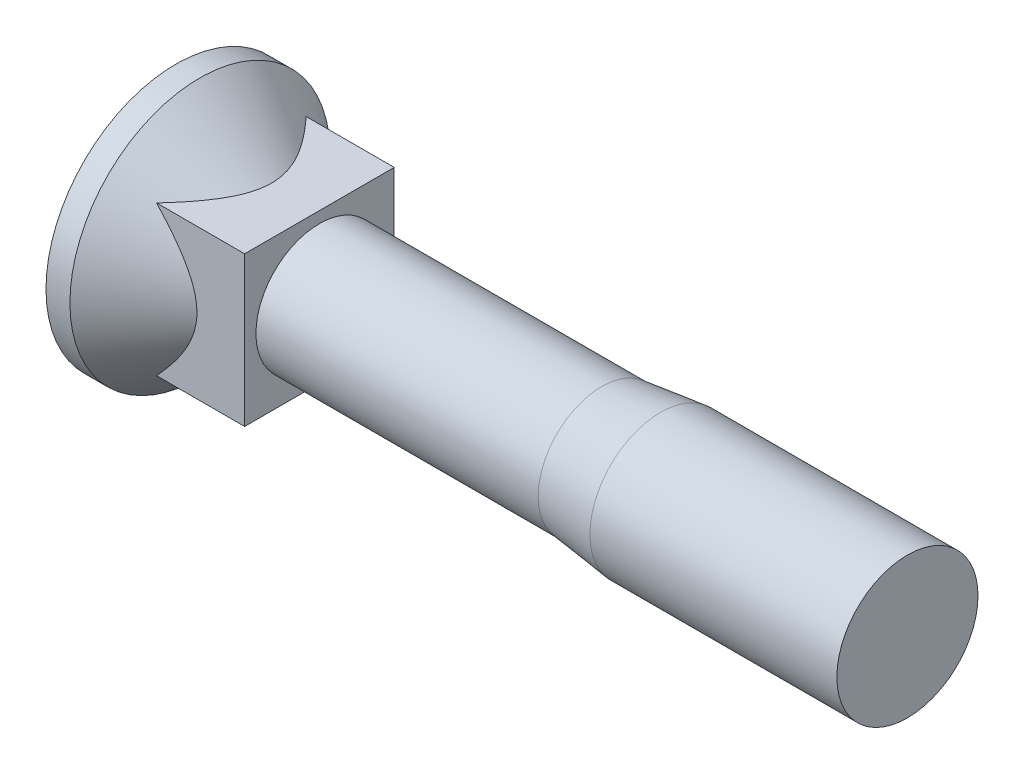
from build123d import *

# Parameters (mm, degrees)
SKETCH2_W      = 6.36
SKETCH2_H      = 6.36
NECK_DEPTH     = 6.1
SKETCH3_R      = 3
BASEBODY_DEPTH = 25


with BuildPart() as part:
    # Sketch1 → BaseHead (revolve)
    with BuildSketch(Plane.XY, mode=Mode.PRIVATE) as basehead_sk:
        Polygon((0, 5.525), (0, 0), (7.554513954, 0), (7.554513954, 0.508333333), (1.016666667, 5.525), align=None)
    revolve(basehead_sk.sketch.rotate(Axis((-5.309810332, 0, 0), (1, 0, 0)), 90), axis=Axis((-5.309810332, 0, 0), (1, 0, 0)))

    # Sketch2 → Neck (add)
    with BuildSketch(Plane(origin=(6.1, 0, 0), x_dir=(0, 0, -1), z_dir=(1, 0, 0))):
        Rectangle(SKETCH2_W, SKETCH2_H)
    extrude(amount=-NECK_DEPTH)

    # Sketch3 → BaseBody (add)
    with BuildSketch(Plane(origin=(6.1, 0, 0), x_dir=(0, 0, -1), z_dir=(1, 0, 0))):
        Circle(SKETCH3_R)
    extrude(amount=BASEBODY_DEPTH)

    # Sketch4 → Cut-Extrude1 (revolve, cut)
    with BuildSketch(Plane(origin=(0, 0, 0), x_dir=(1, 0, 0), z_dir=(0, 1, 0)), mode=Mode.PRIVATE) as cut_extrude1_sk:
        Polygon((6.1, 2.7), (18.1, 2.7), (20.6, 3), (6.1, 3), align=None)
    revolve(cut_extrude1_sk.sketch.rotate(Axis((-1.172871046, 0, 0), (1, 0, 0)), 180), axis=Axis((-1.172871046, 0, 0), (1, 0, 0)), mode=Mode.SUBTRACT)


solid = part.part
